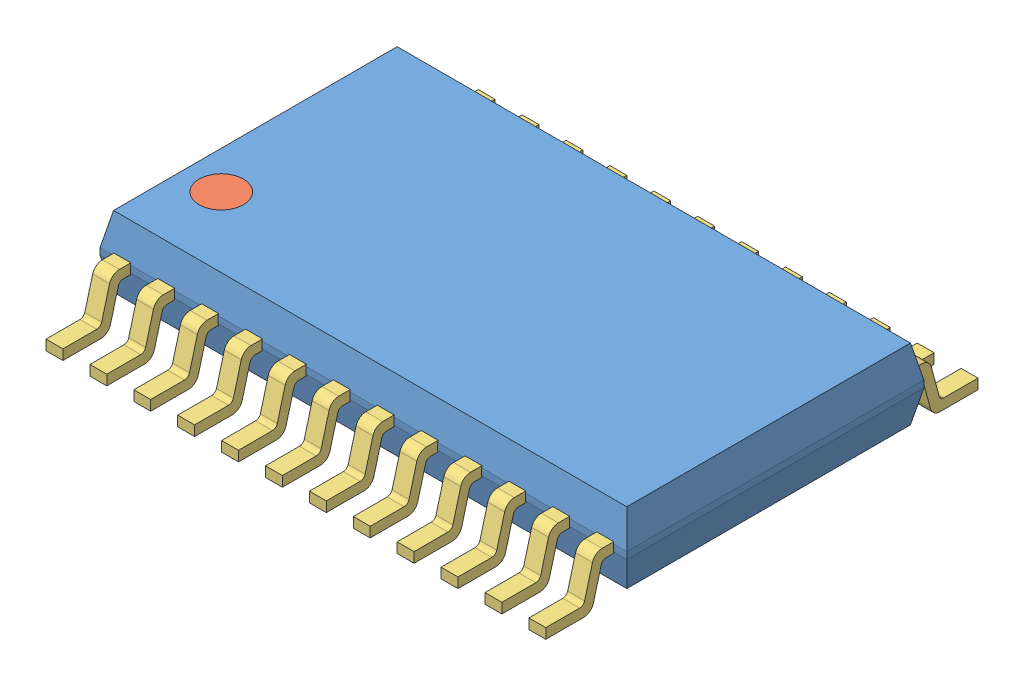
SolidWorks assembly User Library-TSSOP-24.sldasm, configuration Default (file format 9000). Lengths in mm.
Overall size (7.8 1.2 6.4).
14 component instances, 3 part files, 0 mates.
Components (placement in the parent):
- User Library-TSSOP-24__X2_041A043E0440043F04430441_X0_-1: User Library-TSSOP-24__X2_041A043E0440043F04430441_X0_.sldprt [Default] x (-1 0 0) z (0 1 0) size (7.8 4.4 1.05)
- User Library-TSSOP-24__X2_041C04350442043A0430_X0_-1: User Library-TSSOP-24__X2_041C04350442043A0430_X0_.sldprt [Default] x (-1 0 0) z (0 1 0) size (0.66 0.66 0.2)
- User Library-TSSOP-24__X2_041D043E0436043A0430_X0_-1: User Library-TSSOP-24__X2_041D043E0436043A0430_X0_.sldprt [Default] x (0 1 0) z (1 0 0) size (0.75 6.4 0.25)
- User Library-TSSOP-24__X2_041D043E0436043A0430_X0_-2: User Library-TSSOP-24__X2_041D043E0436043A0430_X0_.sldprt [Default] at (0.65 0 0) x (0 1 0) z (1 0 0) size (0.75 6.4 0.25)
- User Library-TSSOP-24__X2_041D043E0436043A0430_X0_-3: User Library-TSSOP-24__X2_041D043E0436043A0430_X0_.sldprt [Default] at (1.3 0 0) x (0 1 0) z (1 0 0) size (0.75 6.4 0.25)
- User Library-TSSOP-24__X2_041D043E0436043A0430_X0_-4: User Library-TSSOP-24__X2_041D043E0436043A0430_X0_.sldprt [Default] at (1.95 0 0) x (0 1 0) z (1 0 0) size (0.75 6.4 0.25)
- User Library-TSSOP-24__X2_041D043E0436043A0430_X0_-5: User Library-TSSOP-24__X2_041D043E0436043A0430_X0_.sldprt [Default] at (2.6 0 0) x (0 1 0) z (1 0 0) size (0.75 6.4 0.25)
- User Library-TSSOP-24__X2_041D043E0436043A0430_X0_-6: User Library-TSSOP-24__X2_041D043E0436043A0430_X0_.sldprt [Default] at (3.25 0 0) x (0 1 0) z (1 0 0) size (0.75 6.4 0.25)
- User Library-TSSOP-24__X2_041D043E0436043A0430_X0_-7: User Library-TSSOP-24__X2_041D043E0436043A0430_X0_.sldprt [Default] at (3.9 0 0) x (0 1 0) z (1 0 0) size (0.75 6.4 0.25)
- User Library-TSSOP-24__X2_041D043E0436043A0430_X0_-8: User Library-TSSOP-24__X2_041D043E0436043A0430_X0_.sldprt [Default] at (4.55 0 0) x (0 1 0) z (1 0 0) size (0.75 6.4 0.25)
- User Library-TSSOP-24__X2_041D043E0436043A0430_X0_-9: User Library-TSSOP-24__X2_041D043E0436043A0430_X0_.sldprt [Default] at (5.2 0 0) x (0 1 0) z (1 0 0) size (0.75 6.4 0.25)
- User Library-TSSOP-24__X2_041D043E0436043A0430_X0_-10: User Library-TSSOP-24__X2_041D043E0436043A0430_X0_.sldprt [Default] at (5.85 0 0) x (0 1 0) z (1 0 0) size (0.75 6.4 0.25)
- User Library-TSSOP-24__X2_041D043E0436043A0430_X0_-11: User Library-TSSOP-24__X2_041D043E0436043A0430_X0_.sldprt [Default] at (6.5 0 0) x (0 1 0) z (1 0 0) size (0.75 6.4 0.25)
- User Library-TSSOP-24__X2_041D043E0436043A0430_X0_-12: User Library-TSSOP-24__X2_041D043E0436043A0430_X0_.sldprt [Default] at (7.15 0 0) x (0 1 0) z (1 0 0) size (0.75 6.4 0.25)
